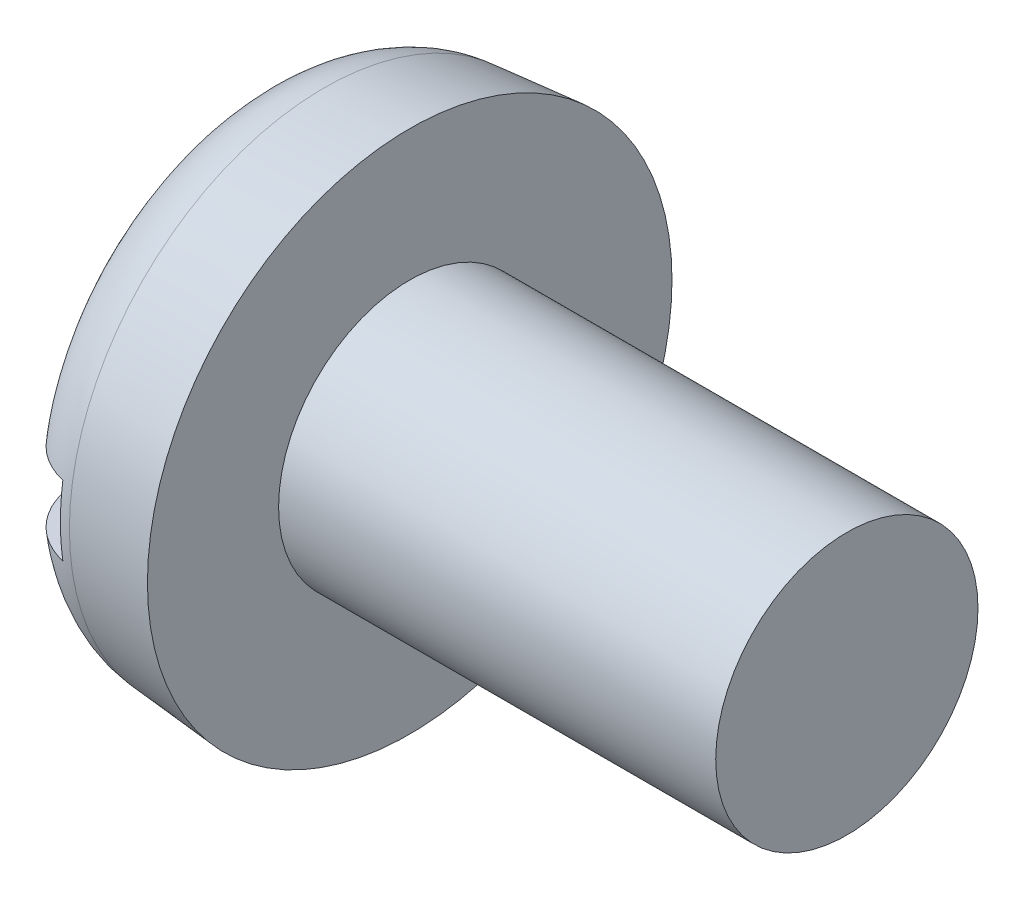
from build123d import *

# Parameters (mm, degrees)
FILLET2_R  = 1.8
SKETCH2_W  = 12
SKETCH2_H  = 1.6
SLOT_DEPTH = 1.4


with BuildPart() as part:
    # BodySke → Base-Revolve (revolve)
    with BuildSketch(Plane.XY, mode=Mode.PRIVATE) as base_revolve_sk:
        Polygon((3.6, 3), (3.6, 6), (0, 5.685040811), (0, 0), (13.6, 0), (13.6, 3), align=None)
    revolve(base_revolve_sk.sketch.rotate(Axis((-25.4, 0, 0), (1, 0, 0)), 90), axis=Axis((-25.4, 0, 0), (1, 0, 0)))

    # Fillet2
    fillet2_edges = [part.edges().sort_by_distance(p)[0] for p in [
        (0, 0, -5.685040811),
    ]]
    fillet(fillet2_edges, radius=FILLET2_R)

    # Sketch2 → Slot (cut)
    with BuildSketch(Plane(origin=(0, 0, 0), x_dir=(0, 0, -1), z_dir=(1, 0, 0))):
        Rectangle(SKETCH2_W, SKETCH2_H)
    extrude(amount=SLOT_DEPTH, mode=Mode.SUBTRACT)


solid = part.part
